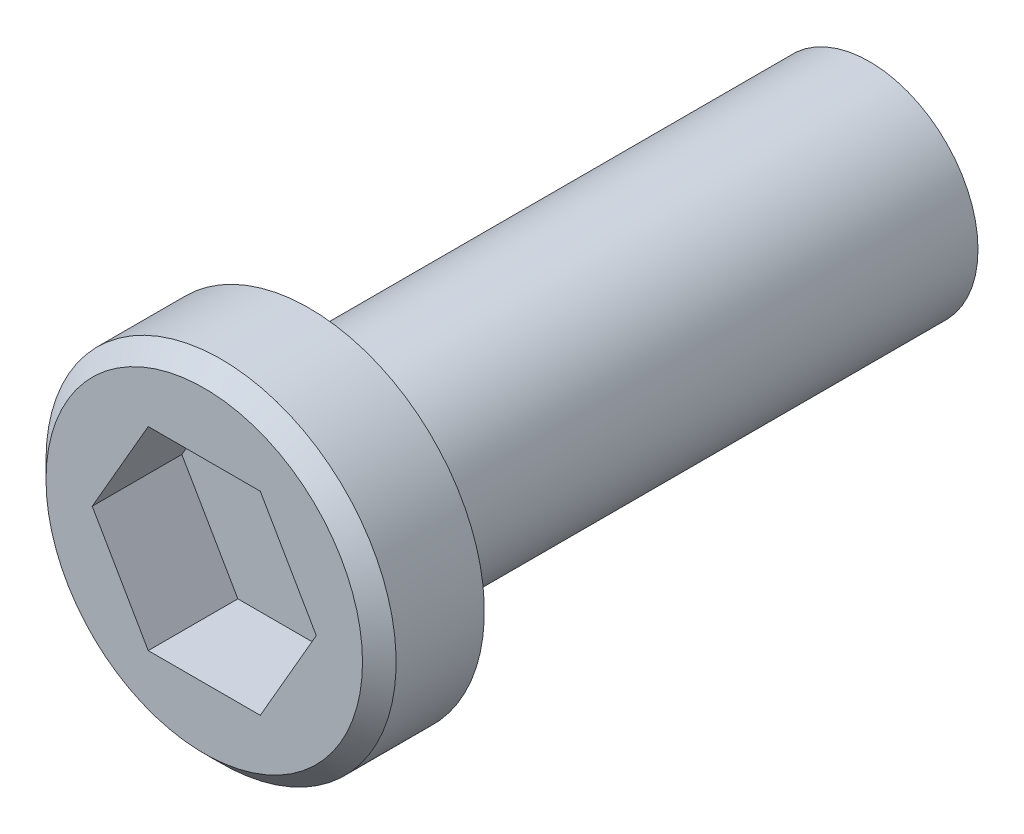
from build123d import *

# Parameters (mm, degrees)
SKETCH1_R          = 4.92125
EXTRUDE1_DEPTH     = 25.4
SKETCH2_R          = 7.9375
EXTRUDE2_DEPTH     = 4.7625
CHAMFER1_SIZE      = 0.762
CUT_EXTRUDE1_DEPTH = 4.064


with BuildPart() as part:
    # Sketch1 → Extrude1 (new body)
    with BuildSketch(Plane.XY):
        Circle(SKETCH1_R)
    extrude(amount=EXTRUDE1_DEPTH)

    # Sketch2 → Extrude2 (add)
    with BuildSketch(Plane.XY.offset(25.4)):
        with Locations(Location((0, 0, 0), (0, 0, 180))):
            Circle(SKETCH2_R)
    extrude(amount=EXTRUDE2_DEPTH)

    # Chamfer1
    chamfer1_edges = [part.edges().sort_by_distance(p)[0] for p in [
        (7.9375, 0, 30.1625),
    ]]
    chamfer(chamfer1_edges, length=CHAMFER1_SIZE)

    # Sketch3 → Cut-Extrude1 (cut)
    with BuildSketch(Plane.XY.offset(30.1625)):
        Polygon((5.08, 0), (2.54, 4.399409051), (-2.54, 4.399409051), (-5.08, 0), (-2.54, -4.399409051), (2.54, -4.399409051), align=None)
    extrude(amount=-CUT_EXTRUDE1_DEPTH, mode=Mode.SUBTRACT)


solid = part.part
